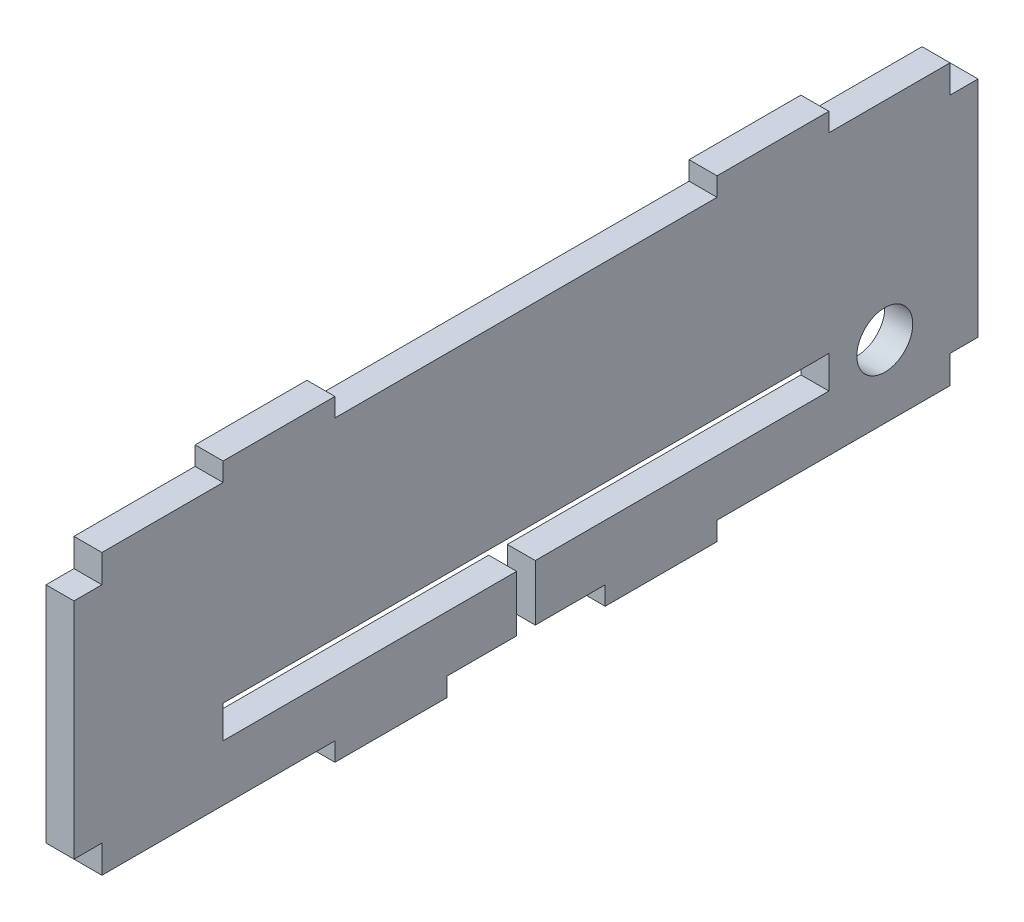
ISO-10303-21;
HEADER;
FILE_DESCRIPTION(('STEP AP214'),'2;1');
FILE_NAME('part.step','',(''),(''),'','','');
FILE_SCHEMA(('AUTOMOTIVE_DESIGN { 1 0 10303 214 1 1 1 1 }'));
ENDSEC;
DATA;
#1=APPLICATION_CONTEXT('core data for automotive mechanical design processes');
#2=APPLICATION_PROTOCOL_DEFINITION('international standard','automotive_design',2000,#1);
#3=PRODUCT_CONTEXT('',#1,'mechanical');
#4=PRODUCT('Part','Part','',(#3));
#5=PRODUCT_RELATED_PRODUCT_CATEGORY('part','',(#4));
#6=PRODUCT_DEFINITION_FORMATION('','',#4);
#7=PRODUCT_DEFINITION_CONTEXT('part definition',#1,'design');
#8=PRODUCT_DEFINITION('design','',#6,#7);
#9=PRODUCT_DEFINITION_SHAPE('','',#8);
#10=(LENGTH_UNIT() NAMED_UNIT(*) SI_UNIT(.MILLI.,.METRE.));
#11=(NAMED_UNIT(*) PLANE_ANGLE_UNIT() SI_UNIT($,.RADIAN.));
#12=(NAMED_UNIT(*) SI_UNIT($,.STERADIAN.) SOLID_ANGLE_UNIT());
#13=UNCERTAINTY_MEASURE_WITH_UNIT(LENGTH_MEASURE(1.E-05),#10,'distance_accuracy_value','');
#14=(GEOMETRIC_REPRESENTATION_CONTEXT(3) GLOBAL_UNCERTAINTY_ASSIGNED_CONTEXT((#13)) GLOBAL_UNIT_ASSIGNED_CONTEXT((#10,
#11,#12)) REPRESENTATION_CONTEXT('',''));
#15=CARTESIAN_POINT('',(0.,0.,0.));
#16=DIRECTION('',(0.,0.,1.));
#17=DIRECTION('',(1.,0.,0.));
#18=AXIS2_PLACEMENT_3D('',#15,#16,#17);
#19=CARTESIAN_POINT('',(3.,29.,0.));
#20=DIRECTION('',(0.,1.,0.));
#21=DIRECTION('',(0.,0.,1.));
#22=AXIS2_PLACEMENT_3D('',#19,#20,#21);
#23=PLANE('',#22);
#24=DIRECTION('',(0.,0.,-1.));
#25=VECTOR('',#24,1.);
#26=CARTESIAN_POINT('',(0.,29.,0.));
#27=LINE('',#26,#25);
#28=CARTESIAN_POINT('',(0.,29.,-94.));
#29=VERTEX_POINT('',#28);
#30=CARTESIAN_POINT('',(0.,29.,-97.));
#31=VERTEX_POINT('',#30);
#32=EDGE_CURVE('E389',#29,#31,#27,.T.);
#33=ORIENTED_EDGE('',*,*,#32,.F.);
#34=DIRECTION('',(-1.,0.,0.));
#35=VECTOR('',#34,1.);
#36=CARTESIAN_POINT('',(3.,29.,-94.));
#37=LINE('',#36,#35);
#38=CARTESIAN_POINT('',(3.,29.,-94.));
#39=VERTEX_POINT('',#38);
#40=EDGE_CURVE('E11',#39,#29,#37,.T.);
#41=ORIENTED_EDGE('',*,*,#40,.F.);
#42=DIRECTION('',(0.,0.,-1.));
#43=VECTOR('',#42,1.);
#44=CARTESIAN_POINT('',(3.,29.,0.));
#45=LINE('',#44,#43);
#46=CARTESIAN_POINT('',(3.,29.,-97.));
#47=VERTEX_POINT('',#46);
#48=EDGE_CURVE('E629',#39,#47,#45,.T.);
#49=ORIENTED_EDGE('',*,*,#48,.T.);
#50=DIRECTION('',(-1.,0.,0.));
#51=VECTOR('',#50,1.);
#52=CARTESIAN_POINT('',(3.,29.,-97.));
#53=LINE('',#52,#51);
#54=EDGE_CURVE('E170',#47,#31,#53,.T.);
#55=ORIENTED_EDGE('',*,*,#54,.T.);
#56=EDGE_LOOP('',(#33,#41,#49,#55));
#57=FACE_BOUND('',#56,.T.);
#58=ADVANCED_FACE('F35',(#57),#23,.T.);
#59=CARTESIAN_POINT('',(3.,0.,-94.));
#60=DIRECTION('',(0.,0.,-1.));
#61=DIRECTION('',(-1.,0.,0.));
#62=AXIS2_PLACEMENT_3D('',#59,#60,#61);
#63=PLANE('',#62);
#64=DIRECTION('',(0.,-1.,0.));
#65=VECTOR('',#64,1.);
#66=CARTESIAN_POINT('',(0.,0.,-94.));
#67=LINE('',#66,#65);
#68=CARTESIAN_POINT('',(0.,32.,-94.));
#69=VERTEX_POINT('',#68);
#70=EDGE_CURVE('E387',#69,#29,#67,.T.);
#71=ORIENTED_EDGE('',*,*,#70,.F.);
#72=DIRECTION('',(-1.,0.,0.));
#73=VECTOR('',#72,1.);
#74=CARTESIAN_POINT('',(3.,32.,-94.));
#75=LINE('',#74,#73);
#76=CARTESIAN_POINT('',(3.,32.,-94.));
#77=VERTEX_POINT('',#76);
#78=EDGE_CURVE('E44',#77,#69,#75,.T.);
#79=ORIENTED_EDGE('',*,*,#78,.F.);
#80=DIRECTION('',(0.,-1.,0.));
#81=VECTOR('',#80,1.);
#82=CARTESIAN_POINT('',(3.,0.,-94.));
#83=LINE('',#82,#81);
#84=EDGE_CURVE('E631',#77,#39,#83,.T.);
#85=ORIENTED_EDGE('',*,*,#84,.T.);
#86=ORIENTED_EDGE('',*,*,#40,.T.);
#87=EDGE_LOOP('',(#71,#79,#85,#86));
#88=FACE_BOUND('',#87,.T.);
#89=ADVANCED_FACE('F388',(#88),#63,.T.);
#90=CARTESIAN_POINT('',(3.,32.,0.));
#91=DIRECTION('',(0.,1.,0.));
#92=DIRECTION('',(0.,0.,1.));
#93=AXIS2_PLACEMENT_3D('',#90,#91,#92);
#94=PLANE('',#93);
#95=DIRECTION('',(0.,0.,-1.));
#96=VECTOR('',#95,1.);
#97=CARTESIAN_POINT('',(0.,32.,0.));
#98=LINE('',#97,#96);
#99=CARTESIAN_POINT('',(0.,32.,-81.));
#100=VERTEX_POINT('',#99);
#101=EDGE_CURVE('E379',#100,#69,#98,.T.);
#102=ORIENTED_EDGE('',*,*,#101,.F.);
#103=DIRECTION('',(-1.,0.,0.));
#104=VECTOR('',#103,1.);
#105=CARTESIAN_POINT('',(3.,32.,-81.));
#106=LINE('',#105,#104);
#107=CARTESIAN_POINT('',(3.,32.,-81.));
#108=VERTEX_POINT('',#107);
#109=EDGE_CURVE('E372',#108,#100,#106,.T.);
#110=ORIENTED_EDGE('',*,*,#109,.F.);
#111=DIRECTION('',(0.,0.,-1.));
#112=VECTOR('',#111,1.);
#113=CARTESIAN_POINT('',(3.,32.,0.));
#114=LINE('',#113,#112);
#115=EDGE_CURVE('E382',#108,#77,#114,.T.);
#116=ORIENTED_EDGE('',*,*,#115,.T.);
#117=ORIENTED_EDGE('',*,*,#78,.T.);
#118=EDGE_LOOP('',(#102,#110,#116,#117));
#119=FACE_BOUND('',#118,.T.);
#120=ADVANCED_FACE('F377',(#119),#94,.T.);
#121=CARTESIAN_POINT('',(3.,0.,-81.));
#122=DIRECTION('',(0.,0.,-1.));
#123=DIRECTION('',(-1.,0.,0.));
#124=AXIS2_PLACEMENT_3D('',#121,#122,#123);
#125=PLANE('',#124);
#126=DIRECTION('',(0.,-1.,0.));
#127=VECTOR('',#126,1.);
#128=CARTESIAN_POINT('',(0.,0.,-81.));
#129=LINE('',#128,#127);
#130=CARTESIAN_POINT('',(0.,34.,-81.));
#131=VERTEX_POINT('',#130);
#132=EDGE_CURVE('E394',#131,#100,#129,.T.);
#133=ORIENTED_EDGE('',*,*,#132,.F.);
#134=DIRECTION('',(-1.,0.,0.));
#135=VECTOR('',#134,1.);
#136=CARTESIAN_POINT('',(3.,34.,-81.));
#137=LINE('',#136,#135);
#138=CARTESIAN_POINT('',(3.,34.,-81.));
#139=VERTEX_POINT('',#138);
#140=EDGE_CURVE('E370',#139,#131,#137,.T.);
#141=ORIENTED_EDGE('',*,*,#140,.F.);
#142=DIRECTION('',(0.,-1.,0.));
#143=VECTOR('',#142,1.);
#144=CARTESIAN_POINT('',(3.,0.,-81.));
#145=LINE('',#144,#143);
#146=EDGE_CURVE('E636',#139,#108,#145,.T.);
#147=ORIENTED_EDGE('',*,*,#146,.T.);
#148=ORIENTED_EDGE('',*,*,#109,.T.);
#149=EDGE_LOOP('',(#133,#141,#147,#148));
#150=FACE_BOUND('',#149,.T.);
#151=ADVANCED_FACE('F497',(#150),#125,.T.);
#152=CARTESIAN_POINT('',(3.,34.,0.));
#153=DIRECTION('',(0.,1.,0.));
#154=DIRECTION('',(0.,0.,1.));
#155=AXIS2_PLACEMENT_3D('',#152,#153,#154);
#156=PLANE('',#155);
#157=DIRECTION('',(0.,0.,-1.));
#158=VECTOR('',#157,1.);
#159=CARTESIAN_POINT('',(0.,34.,0.));
#160=LINE('',#159,#158);
#161=CARTESIAN_POINT('',(0.,34.,-69.));
#162=VERTEX_POINT('',#161);
#163=EDGE_CURVE('E396',#162,#131,#160,.T.);
#164=ORIENTED_EDGE('',*,*,#163,.F.);
#165=DIRECTION('',(-1.,0.,0.));
#166=VECTOR('',#165,1.);
#167=CARTESIAN_POINT('',(3.,34.,-69.));
#168=LINE('',#167,#166);
#169=CARTESIAN_POINT('',(3.,34.,-69.));
#170=VERTEX_POINT('',#169);
#171=EDGE_CURVE('E368',#170,#162,#168,.T.);
#172=ORIENTED_EDGE('',*,*,#171,.F.);
#173=DIRECTION('',(0.,0.,-1.));
#174=VECTOR('',#173,1.);
#175=CARTESIAN_POINT('',(3.,34.,0.));
#176=LINE('',#175,#174);
#177=EDGE_CURVE('E639',#170,#139,#176,.T.);
#178=ORIENTED_EDGE('',*,*,#177,.T.);
#179=ORIENTED_EDGE('',*,*,#140,.T.);
#180=EDGE_LOOP('',(#164,#172,#178,#179));
#181=FACE_BOUND('',#180,.T.);
#182=ADVANCED_FACE('F500',(#181),#156,.T.);
#183=CARTESIAN_POINT('',(3.,0.,-69.));
#184=DIRECTION('',(0.,0.,1.));
#185=DIRECTION('',(1.,0.,0.));
#186=AXIS2_PLACEMENT_3D('',#183,#184,#185);
#187=PLANE('',#186);
#188=DIRECTION('',(0.,1.,0.));
#189=VECTOR('',#188,1.);
#190=CARTESIAN_POINT('',(0.,0.,-69.));
#191=LINE('',#190,#189);
#192=CARTESIAN_POINT('',(0.,32.,-69.));
#193=VERTEX_POINT('',#192);
#194=EDGE_CURVE('E401',#193,#162,#191,.T.);
#195=ORIENTED_EDGE('',*,*,#194,.F.);
#196=DIRECTION('',(-1.,0.,0.));
#197=VECTOR('',#196,1.);
#198=CARTESIAN_POINT('',(3.,32.,-69.));
#199=LINE('',#198,#197);
#200=CARTESIAN_POINT('',(3.,32.,-69.));
#201=VERTEX_POINT('',#200);
#202=EDGE_CURVE('E366',#201,#193,#199,.T.);
#203=ORIENTED_EDGE('',*,*,#202,.F.);
#204=DIRECTION('',(0.,1.,0.));
#205=VECTOR('',#204,1.);
#206=CARTESIAN_POINT('',(3.,0.,-69.));
#207=LINE('',#206,#205);
#208=EDGE_CURVE('E642',#201,#170,#207,.T.);
#209=ORIENTED_EDGE('',*,*,#208,.T.);
#210=ORIENTED_EDGE('',*,*,#171,.T.);
#211=EDGE_LOOP('',(#195,#203,#209,#210));
#212=FACE_BOUND('',#211,.T.);
#213=ADVANCED_FACE('F502',(#212),#187,.T.);
#214=CARTESIAN_POINT('',(3.,32.,0.));
#215=DIRECTION('',(0.,1.,0.));
#216=DIRECTION('',(0.,0.,1.));
#217=AXIS2_PLACEMENT_3D('',#214,#215,#216);
#218=PLANE('',#217);
#219=DIRECTION('',(0.,0.,-1.));
#220=VECTOR('',#219,1.);
#221=CARTESIAN_POINT('',(0.,32.,0.));
#222=LINE('',#221,#220);
#223=CARTESIAN_POINT('',(0.,32.,-28.));
#224=VERTEX_POINT('',#223);
#225=EDGE_CURVE('E405',#224,#193,#222,.T.);
#226=ORIENTED_EDGE('',*,*,#225,.F.);
#227=DIRECTION('',(-1.,0.,0.));
#228=VECTOR('',#227,1.);
#229=CARTESIAN_POINT('',(3.,32.,-28.));
#230=LINE('',#229,#228);
#231=CARTESIAN_POINT('',(3.,32.,-28.));
#232=VERTEX_POINT('',#231);
#233=EDGE_CURVE('E364',#232,#224,#230,.T.);
#234=ORIENTED_EDGE('',*,*,#233,.F.);
#235=DIRECTION('',(0.,0.,-1.));
#236=VECTOR('',#235,1.);
#237=CARTESIAN_POINT('',(3.,32.,0.));
#238=LINE('',#237,#236);
#239=EDGE_CURVE('E646',#232,#201,#238,.T.);
#240=ORIENTED_EDGE('',*,*,#239,.T.);
#241=ORIENTED_EDGE('',*,*,#202,.T.);
#242=EDGE_LOOP('',(#226,#234,#240,#241));
#243=FACE_BOUND('',#242,.T.);
#244=ADVANCED_FACE('F505',(#243),#218,.T.);
#245=CARTESIAN_POINT('',(3.,0.,-28.));
#246=DIRECTION('',(0.,0.,-1.));
#247=DIRECTION('',(-1.,0.,0.));
#248=AXIS2_PLACEMENT_3D('',#245,#246,#247);
#249=PLANE('',#248);
#250=DIRECTION('',(0.,-1.,0.));
#251=VECTOR('',#250,1.);
#252=CARTESIAN_POINT('',(0.,0.,-28.));
#253=LINE('',#252,#251);
#254=CARTESIAN_POINT('',(0.,34.,-28.));
#255=VERTEX_POINT('',#254);
#256=EDGE_CURVE('E408',#255,#224,#253,.T.);
#257=ORIENTED_EDGE('',*,*,#256,.F.);
#258=DIRECTION('',(-1.,0.,0.));
#259=VECTOR('',#258,1.);
#260=CARTESIAN_POINT('',(3.,34.,-28.));
#261=LINE('',#260,#259);
#262=CARTESIAN_POINT('',(3.,34.,-28.));
#263=VERTEX_POINT('',#262);
#264=EDGE_CURVE('E362',#263,#255,#261,.T.);
#265=ORIENTED_EDGE('',*,*,#264,.F.);
#266=DIRECTION('',(0.,-1.,0.));
#267=VECTOR('',#266,1.);
#268=CARTESIAN_POINT('',(3.,0.,-28.));
#269=LINE('',#268,#267);
#270=EDGE_CURVE('E649',#263,#232,#269,.T.);
#271=ORIENTED_EDGE('',*,*,#270,.T.);
#272=ORIENTED_EDGE('',*,*,#233,.T.);
#273=EDGE_LOOP('',(#257,#265,#271,#272));
#274=FACE_BOUND('',#273,.T.);
#275=ADVANCED_FACE('F509',(#274),#249,.T.);
#276=CARTESIAN_POINT('',(0.,34.,-16.));
#277=VERTEX_POINT('',#276);
#278=EDGE_CURVE('E402',#277,#255,#160,.T.);
#279=ORIENTED_EDGE('',*,*,#278,.F.);
#280=DIRECTION('',(-1.,0.,0.));
#281=VECTOR('',#280,1.);
#282=CARTESIAN_POINT('',(3.,34.,-16.));
#283=LINE('',#282,#281);
#284=CARTESIAN_POINT('',(3.,34.,-16.));
#285=VERTEX_POINT('',#284);
#286=EDGE_CURVE('E360',#285,#277,#283,.T.);
#287=ORIENTED_EDGE('',*,*,#286,.F.);
#288=EDGE_CURVE('E643',#285,#263,#176,.T.);
#289=ORIENTED_EDGE('',*,*,#288,.T.);
#290=ORIENTED_EDGE('',*,*,#264,.T.);
#291=EDGE_LOOP('',(#279,#287,#289,#290));
#292=FACE_BOUND('',#291,.T.);
#293=ADVANCED_FACE('F513',(#292),#156,.T.);
#294=CARTESIAN_POINT('',(3.,0.,-16.));
#295=DIRECTION('',(0.,0.,1.));
#296=DIRECTION('',(1.,0.,0.));
#297=AXIS2_PLACEMENT_3D('',#294,#295,#296);
#298=PLANE('',#297);
#299=DIRECTION('',(0.,1.,0.));
#300=VECTOR('',#299,1.);
#301=CARTESIAN_POINT('',(0.,0.,-16.));
#302=LINE('',#301,#300);
#303=CARTESIAN_POINT('',(0.,32.,-16.));
#304=VERTEX_POINT('',#303);
#305=EDGE_CURVE('E411',#304,#277,#302,.T.);
#306=ORIENTED_EDGE('',*,*,#305,.F.);
#307=DIRECTION('',(-1.,0.,0.));
#308=VECTOR('',#307,1.);
#309=CARTESIAN_POINT('',(3.,32.,-16.));
#310=LINE('',#309,#308);
#311=CARTESIAN_POINT('',(3.,32.,-16.));
#312=VERTEX_POINT('',#311);
#313=EDGE_CURVE('E358',#312,#304,#310,.T.);
#314=ORIENTED_EDGE('',*,*,#313,.F.);
#315=DIRECTION('',(0.,1.,0.));
#316=VECTOR('',#315,1.);
#317=CARTESIAN_POINT('',(3.,0.,-16.));
#318=LINE('',#317,#316);
#319=EDGE_CURVE('E652',#312,#285,#318,.T.);
#320=ORIENTED_EDGE('',*,*,#319,.T.);
#321=ORIENTED_EDGE('',*,*,#286,.T.);
#322=EDGE_LOOP('',(#306,#314,#320,#321));
#323=FACE_BOUND('',#322,.T.);
#324=ADVANCED_FACE('F517',(#323),#298,.T.);
#325=CARTESIAN_POINT('',(3.,32.,0.));
#326=DIRECTION('',(0.,1.,0.));
#327=DIRECTION('',(0.,0.,1.));
#328=AXIS2_PLACEMENT_3D('',#325,#326,#327);
#329=PLANE('',#328);
#330=DIRECTION('',(0.,0.,-1.));
#331=VECTOR('',#330,1.);
#332=CARTESIAN_POINT('',(0.,32.,0.));
#333=LINE('',#332,#331);
#334=CARTESIAN_POINT('',(0.,32.,-2.99999999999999));
#335=VERTEX_POINT('',#334);
#336=EDGE_CURVE('E414',#335,#304,#333,.T.);
#337=ORIENTED_EDGE('',*,*,#336,.F.);
#338=DIRECTION('',(-1.,0.,0.));
#339=VECTOR('',#338,1.);
#340=CARTESIAN_POINT('',(3.,32.,-2.99999999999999));
#341=LINE('',#340,#339);
#342=CARTESIAN_POINT('',(3.,32.,-2.99999999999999));
#343=VERTEX_POINT('',#342);
#344=EDGE_CURVE('E356',#343,#335,#341,.T.);
#345=ORIENTED_EDGE('',*,*,#344,.F.);
#346=DIRECTION('',(0.,0.,-1.));
#347=VECTOR('',#346,1.);
#348=CARTESIAN_POINT('',(3.,32.,0.));
#349=LINE('',#348,#347);
#350=EDGE_CURVE('E655',#343,#312,#349,.T.);
#351=ORIENTED_EDGE('',*,*,#350,.T.);
#352=ORIENTED_EDGE('',*,*,#313,.T.);
#353=EDGE_LOOP('',(#337,#345,#351,#352));
#354=FACE_BOUND('',#353,.T.);
#355=ADVANCED_FACE('F521',(#354),#329,.T.);
#356=CARTESIAN_POINT('',(3.,0.,-2.99999999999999));
#357=DIRECTION('',(0.,0.,1.));
#358=DIRECTION('',(1.,0.,0.));
#359=AXIS2_PLACEMENT_3D('',#356,#357,#358);
#360=PLANE('',#359);
#361=DIRECTION('',(0.,1.,0.));
#362=VECTOR('',#361,1.);
#363=CARTESIAN_POINT('',(0.,0.,-2.99999999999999));
#364=LINE('',#363,#362);
#365=CARTESIAN_POINT('',(0.,29.,-2.99999999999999));
#366=VERTEX_POINT('',#365);
#367=EDGE_CURVE('E417',#366,#335,#364,.T.);
#368=ORIENTED_EDGE('',*,*,#367,.F.);
#369=DIRECTION('',(-1.,0.,0.));
#370=VECTOR('',#369,1.);
#371=CARTESIAN_POINT('',(3.,29.,-2.99999999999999));
#372=LINE('',#371,#370);
#373=CARTESIAN_POINT('',(3.,29.,-2.99999999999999));
#374=VERTEX_POINT('',#373);
#375=EDGE_CURVE('E354',#374,#366,#372,.T.);
#376=ORIENTED_EDGE('',*,*,#375,.F.);
#377=DIRECTION('',(0.,1.,0.));
#378=VECTOR('',#377,1.);
#379=CARTESIAN_POINT('',(3.,0.,-2.99999999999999));
#380=LINE('',#379,#378);
#381=EDGE_CURVE('E658',#374,#343,#380,.T.);
#382=ORIENTED_EDGE('',*,*,#381,.T.);
#383=ORIENTED_EDGE('',*,*,#344,.T.);
#384=EDGE_LOOP('',(#368,#376,#382,#383));
#385=FACE_BOUND('',#384,.T.);
#386=ADVANCED_FACE('F525',(#385),#360,.T.);
#387=CARTESIAN_POINT('',(3.,29.,0.));
#388=DIRECTION('',(0.,1.,0.));
#389=DIRECTION('',(0.,0.,1.));
#390=AXIS2_PLACEMENT_3D('',#387,#388,#389);
#391=PLANE('',#390);
#392=DIRECTION('',(0.,0.,-1.));
#393=VECTOR('',#392,1.);
#394=CARTESIAN_POINT('',(0.,29.,0.));
#395=LINE('',#394,#393);
#396=CARTESIAN_POINT('',(0.,29.,0.));
#397=VERTEX_POINT('',#396);
#398=EDGE_CURVE('E420',#397,#366,#395,.T.);
#399=ORIENTED_EDGE('',*,*,#398,.F.);
#400=DIRECTION('',(-1.,0.,0.));
#401=VECTOR('',#400,1.);
#402=CARTESIAN_POINT('',(3.,29.,0.));
#403=LINE('',#402,#401);
#404=CARTESIAN_POINT('',(3.,29.,0.));
#405=VERTEX_POINT('',#404);
#406=EDGE_CURVE('E352',#405,#397,#403,.T.);
#407=ORIENTED_EDGE('',*,*,#406,.F.);
#408=DIRECTION('',(0.,0.,-1.));
#409=VECTOR('',#408,1.);
#410=CARTESIAN_POINT('',(3.,29.,0.));
#411=LINE('',#410,#409);
#412=EDGE_CURVE('E661',#405,#374,#411,.T.);
#413=ORIENTED_EDGE('',*,*,#412,.T.);
#414=ORIENTED_EDGE('',*,*,#375,.T.);
#415=EDGE_LOOP('',(#399,#407,#413,#414));
#416=FACE_BOUND('',#415,.T.);
#417=ADVANCED_FACE('F529',(#416),#391,.T.);
#418=CARTESIAN_POINT('',(3.,0.,0.));
#419=DIRECTION('',(0.,0.,-1.));
#420=DIRECTION('',(-1.,0.,0.));
#421=AXIS2_PLACEMENT_3D('',#418,#419,#420);
#422=PLANE('',#421);
#423=DIRECTION('',(0.,-1.,0.));
#424=VECTOR('',#423,1.);
#425=CARTESIAN_POINT('',(0.,0.,0.));
#426=LINE('',#425,#424);
#427=CARTESIAN_POINT('',(0.,5.,0.));
#428=VERTEX_POINT('',#427);
#429=EDGE_CURVE('E423',#397,#428,#426,.T.);
#430=ORIENTED_EDGE('',*,*,#429,.T.);
#431=DIRECTION('',(-1.,0.,0.));
#432=VECTOR('',#431,1.);
#433=CARTESIAN_POINT('',(3.,5.,0.));
#434=LINE('',#433,#432);
#435=CARTESIAN_POINT('',(3.,5.,0.));
#436=VERTEX_POINT('',#435);
#437=EDGE_CURVE('E349',#436,#428,#434,.T.);
#438=ORIENTED_EDGE('',*,*,#437,.F.);
#439=DIRECTION('',(0.,-1.,0.));
#440=VECTOR('',#439,1.);
#441=CARTESIAN_POINT('',(3.,0.,0.));
#442=LINE('',#441,#440);
#443=EDGE_CURVE('E664',#405,#436,#442,.T.);
#444=ORIENTED_EDGE('',*,*,#443,.F.);
#445=ORIENTED_EDGE('',*,*,#406,.T.);
#446=EDGE_LOOP('',(#430,#438,#444,#445));
#447=FACE_BOUND('',#446,.T.);
#448=ADVANCED_FACE('F533',(#447),#422,.F.);
#449=CARTESIAN_POINT('',(3.,5.,0.));
#450=DIRECTION('',(0.,1.,0.));
#451=DIRECTION('',(0.,0.,1.));
#452=AXIS2_PLACEMENT_3D('',#449,#450,#451);
#453=PLANE('',#452);
#454=DIRECTION('',(0.,0.,-1.));
#455=VECTOR('',#454,1.);
#456=CARTESIAN_POINT('',(0.,5.,0.));
#457=LINE('',#456,#455);
#458=CARTESIAN_POINT('',(0.,5.,-3.));
#459=VERTEX_POINT('',#458);
#460=EDGE_CURVE('E426',#428,#459,#457,.T.);
#461=ORIENTED_EDGE('',*,*,#460,.T.);
#462=DIRECTION('',(-1.,0.,0.));
#463=VECTOR('',#462,1.);
#464=CARTESIAN_POINT('',(3.,5.,-3.));
#465=LINE('',#464,#463);
#466=CARTESIAN_POINT('',(3.,5.,-3.));
#467=VERTEX_POINT('',#466);
#468=EDGE_CURVE('E346',#467,#459,#465,.T.);
#469=ORIENTED_EDGE('',*,*,#468,.F.);
#470=DIRECTION('',(0.,0.,-1.));
#471=VECTOR('',#470,1.);
#472=CARTESIAN_POINT('',(3.,5.,0.));
#473=LINE('',#472,#471);
#474=EDGE_CURVE('E667',#436,#467,#473,.T.);
#475=ORIENTED_EDGE('',*,*,#474,.F.);
#476=ORIENTED_EDGE('',*,*,#437,.T.);
#477=EDGE_LOOP('',(#461,#469,#475,#476));
#478=FACE_BOUND('',#477,.T.);
#479=ADVANCED_FACE('F537',(#478),#453,.F.);
#480=CARTESIAN_POINT('',(3.,0.,-3.));
#481=DIRECTION('',(0.,0.,-1.));
#482=DIRECTION('',(0.,1.,0.));
#483=AXIS2_PLACEMENT_3D('',#480,#481,#482);
#484=PLANE('',#483);
#485=DIRECTION('',(0.,-1.,0.));
#486=VECTOR('',#485,1.);
#487=CARTESIAN_POINT('',(0.,0.,-3.));
#488=LINE('',#487,#486);
#489=CARTESIAN_POINT('',(0.,2.,-3.));
#490=VERTEX_POINT('',#489);
#491=EDGE_CURVE('E429',#459,#490,#488,.T.);
#492=ORIENTED_EDGE('',*,*,#491,.T.);
#493=DIRECTION('',(-1.,0.,0.));
#494=VECTOR('',#493,1.);
#495=CARTESIAN_POINT('',(3.,2.,-3.));
#496=LINE('',#495,#494);
#497=CARTESIAN_POINT('',(3.,2.,-3.));
#498=VERTEX_POINT('',#497);
#499=EDGE_CURVE('E343',#498,#490,#496,.T.);
#500=ORIENTED_EDGE('',*,*,#499,.F.);
#501=DIRECTION('',(0.,-1.,0.));
#502=VECTOR('',#501,1.);
#503=CARTESIAN_POINT('',(3.,0.,-3.));
#504=LINE('',#503,#502);
#505=EDGE_CURVE('E670',#467,#498,#504,.T.);
#506=ORIENTED_EDGE('',*,*,#505,.F.);
#507=ORIENTED_EDGE('',*,*,#468,.T.);
#508=EDGE_LOOP('',(#492,#500,#506,#507));
#509=FACE_BOUND('',#508,.T.);
#510=ADVANCED_FACE('F541',(#509),#484,.F.);
#511=CARTESIAN_POINT('',(3.,2.,0.));
#512=DIRECTION('',(0.,1.,0.));
#513=DIRECTION('',(0.,0.,1.));
#514=AXIS2_PLACEMENT_3D('',#511,#512,#513);
#515=PLANE('',#514);
#516=DIRECTION('',(0.,0.,-1.));
#517=VECTOR('',#516,1.);
#518=CARTESIAN_POINT('',(0.,2.,0.));
#519=LINE('',#518,#517);
#520=CARTESIAN_POINT('',(0.,2.,-28.));
#521=VERTEX_POINT('',#520);
#522=EDGE_CURVE('E432',#490,#521,#519,.T.);
#523=ORIENTED_EDGE('',*,*,#522,.T.);
#524=DIRECTION('',(-1.,0.,0.));
#525=VECTOR('',#524,1.);
#526=CARTESIAN_POINT('',(3.,2.,-28.));
#527=LINE('',#526,#525);
#528=CARTESIAN_POINT('',(3.,2.,-28.));
#529=VERTEX_POINT('',#528);
#530=EDGE_CURVE('E340',#529,#521,#527,.T.);
#531=ORIENTED_EDGE('',*,*,#530,.F.);
#532=DIRECTION('',(0.,0.,-1.));
#533=VECTOR('',#532,1.);
#534=CARTESIAN_POINT('',(3.,2.,0.));
#535=LINE('',#534,#533);
#536=EDGE_CURVE('E673',#498,#529,#535,.T.);
#537=ORIENTED_EDGE('',*,*,#536,.F.);
#538=ORIENTED_EDGE('',*,*,#499,.T.);
#539=EDGE_LOOP('',(#523,#531,#537,#538));
#540=FACE_BOUND('',#539,.T.);
#541=ADVANCED_FACE('F545',(#540),#515,.F.);
#542=CARTESIAN_POINT('',(3.,0.,-28.));
#543=DIRECTION('',(0.,0.,-1.));
#544=DIRECTION('',(-1.,0.,0.));
#545=AXIS2_PLACEMENT_3D('',#542,#543,#544);
#546=PLANE('',#545);
#547=DIRECTION('',(0.,-1.,0.));
#548=VECTOR('',#547,1.);
#549=CARTESIAN_POINT('',(0.,0.,-28.));
#550=LINE('',#549,#548);
#551=CARTESIAN_POINT('',(0.,0.,-28.));
#552=VERTEX_POINT('',#551);
#553=EDGE_CURVE('E435',#521,#552,#550,.T.);
#554=ORIENTED_EDGE('',*,*,#553,.T.);
#555=DIRECTION('',(-1.,0.,0.));
#556=VECTOR('',#555,1.);
#557=CARTESIAN_POINT('',(3.,0.,-28.));
#558=LINE('',#557,#556);
#559=CARTESIAN_POINT('',(3.,0.,-28.));
#560=VERTEX_POINT('',#559);
#561=EDGE_CURVE('E337',#560,#552,#558,.T.);
#562=ORIENTED_EDGE('',*,*,#561,.F.);
#563=DIRECTION('',(0.,-1.,0.));
#564=VECTOR('',#563,1.);
#565=CARTESIAN_POINT('',(3.,0.,-28.));
#566=LINE('',#565,#564);
#567=EDGE_CURVE('E676',#529,#560,#566,.T.);
#568=ORIENTED_EDGE('',*,*,#567,.F.);
#569=ORIENTED_EDGE('',*,*,#530,.T.);
#570=EDGE_LOOP('',(#554,#562,#568,#569));
#571=FACE_BOUND('',#570,.T.);
#572=ADVANCED_FACE('F549',(#571),#546,.F.);
#573=CARTESIAN_POINT('',(3.,0.,0.));
#574=DIRECTION('',(0.,1.,0.));
#575=DIRECTION('',(0.,0.,1.));
#576=AXIS2_PLACEMENT_3D('',#573,#574,#575);
#577=PLANE('',#576);
#578=DIRECTION('',(0.,0.,-1.));
#579=VECTOR('',#578,1.);
#580=CARTESIAN_POINT('',(0.,0.,0.));
#581=LINE('',#580,#579);
#582=CARTESIAN_POINT('',(0.,0.,-40.));
#583=VERTEX_POINT('',#582);
#584=EDGE_CURVE('E438',#552,#583,#581,.T.);
#585=ORIENTED_EDGE('',*,*,#584,.T.);
#586=DIRECTION('',(-1.,0.,0.));
#587=VECTOR('',#586,1.);
#588=CARTESIAN_POINT('',(3.,0.,-40.));
#589=LINE('',#588,#587);
#590=CARTESIAN_POINT('',(3.,0.,-40.));
#591=VERTEX_POINT('',#590);
#592=EDGE_CURVE('E334',#591,#583,#589,.T.);
#593=ORIENTED_EDGE('',*,*,#592,.F.);
#594=DIRECTION('',(0.,0.,-1.));
#595=VECTOR('',#594,1.);
#596=CARTESIAN_POINT('',(3.,0.,0.));
#597=LINE('',#596,#595);
#598=EDGE_CURVE('E679',#560,#591,#597,.T.);
#599=ORIENTED_EDGE('',*,*,#598,.F.);
#600=ORIENTED_EDGE('',*,*,#561,.T.);
#601=EDGE_LOOP('',(#585,#593,#599,#600));
#602=FACE_BOUND('',#601,.T.);
#603=ADVANCED_FACE('F553',(#602),#577,.F.);
#604=CARTESIAN_POINT('',(3.,0.,-40.));
#605=DIRECTION('',(0.,0.,1.));
#606=DIRECTION('',(1.,0.,0.));
#607=AXIS2_PLACEMENT_3D('',#604,#605,#606);
#608=PLANE('',#607);
#609=DIRECTION('',(0.,1.,0.));
#610=VECTOR('',#609,1.);
#611=CARTESIAN_POINT('',(0.,0.,-40.));
#612=LINE('',#611,#610);
#613=CARTESIAN_POINT('',(0.,2.,-40.));
#614=VERTEX_POINT('',#613);
#615=EDGE_CURVE('E441',#583,#614,#612,.T.);
#616=ORIENTED_EDGE('',*,*,#615,.T.);
#617=DIRECTION('',(-1.,0.,0.));
#618=VECTOR('',#617,1.);
#619=CARTESIAN_POINT('',(3.,2.,-40.));
#620=LINE('',#619,#618);
#621=CARTESIAN_POINT('',(3.,2.,-40.));
#622=VERTEX_POINT('',#621);
#623=EDGE_CURVE('E332',#622,#614,#620,.T.);
#624=ORIENTED_EDGE('',*,*,#623,.F.);
#625=DIRECTION('',(0.,1.,0.));
#626=VECTOR('',#625,1.);
#627=CARTESIAN_POINT('',(3.,0.,-40.));
#628=LINE('',#627,#626);
#629=EDGE_CURVE('E682',#591,#622,#628,.T.);
#630=ORIENTED_EDGE('',*,*,#629,.F.);
#631=ORIENTED_EDGE('',*,*,#592,.T.);
#632=EDGE_LOOP('',(#616,#624,#630,#631));
#633=FACE_BOUND('',#632,.T.);
#634=ADVANCED_FACE('F555',(#633),#608,.F.);
#635=CARTESIAN_POINT('',(3.,2.,0.));
#636=DIRECTION('',(0.,-1.,0.));
#637=DIRECTION('',(0.,0.,-1.));
#638=AXIS2_PLACEMENT_3D('',#635,#636,#637);
#639=PLANE('',#638);
#640=DIRECTION('',(0.,0.,1.));
#641=VECTOR('',#640,1.);
#642=CARTESIAN_POINT('',(0.,2.,0.));
#643=LINE('',#642,#641);
#644=CARTESIAN_POINT('',(0.,2.,-47.5));
#645=VERTEX_POINT('',#644);
#646=EDGE_CURVE('E445',#645,#614,#643,.T.);
#647=ORIENTED_EDGE('',*,*,#646,.F.);
#648=DIRECTION('',(-1.,0.,0.));
#649=VECTOR('',#648,1.);
#650=CARTESIAN_POINT('',(3.,2.,-47.5));
#651=LINE('',#650,#649);
#652=CARTESIAN_POINT('',(3.,2.,-47.5));
#653=VERTEX_POINT('',#652);
#654=EDGE_CURVE('E330',#653,#645,#651,.T.);
#655=ORIENTED_EDGE('',*,*,#654,.F.);
#656=DIRECTION('',(0.,0.,1.));
#657=VECTOR('',#656,1.);
#658=CARTESIAN_POINT('',(3.,2.,0.));
#659=LINE('',#658,#657);
#660=EDGE_CURVE('E685',#653,#622,#659,.T.);
#661=ORIENTED_EDGE('',*,*,#660,.T.);
#662=ORIENTED_EDGE('',*,*,#623,.T.);
#663=EDGE_LOOP('',(#647,#655,#661,#662));
#664=FACE_BOUND('',#663,.T.);
#665=ADVANCED_FACE('F558',(#664),#639,.T.);
#666=CARTESIAN_POINT('',(3.,0.,-47.5));
#667=DIRECTION('',(0.,0.,-1.));
#668=DIRECTION('',(-1.,0.,0.));
#669=AXIS2_PLACEMENT_3D('',#666,#667,#668);
#670=PLANE('',#669);
#671=DIRECTION('',(0.,-1.,0.));
#672=VECTOR('',#671,1.);
#673=CARTESIAN_POINT('',(0.,0.,-47.5));
#674=LINE('',#673,#672);
#675=CARTESIAN_POINT('',(0.,8.,-47.5));
#676=VERTEX_POINT('',#675);
#677=EDGE_CURVE('E448',#676,#645,#674,.T.);
#678=ORIENTED_EDGE('',*,*,#677,.F.);
#679=DIRECTION('',(-1.,0.,0.));
#680=VECTOR('',#679,1.);
#681=CARTESIAN_POINT('',(3.,8.,-47.5));
#682=LINE('',#681,#680);
#683=CARTESIAN_POINT('',(3.,8.,-47.5));
#684=VERTEX_POINT('',#683);
#685=EDGE_CURVE('E328',#684,#676,#682,.T.);
#686=ORIENTED_EDGE('',*,*,#685,.F.);
#687=DIRECTION('',(0.,-1.,0.));
#688=VECTOR('',#687,1.);
#689=CARTESIAN_POINT('',(3.,0.,-47.5));
#690=LINE('',#689,#688);
#691=EDGE_CURVE('E688',#684,#653,#690,.T.);
#692=ORIENTED_EDGE('',*,*,#691,.T.);
#693=ORIENTED_EDGE('',*,*,#654,.T.);
#694=EDGE_LOOP('',(#678,#686,#692,#693));
#695=FACE_BOUND('',#694,.T.);
#696=ADVANCED_FACE('F562',(#695),#670,.T.);
#697=CARTESIAN_POINT('',(3.,8.,0.));
#698=DIRECTION('',(0.,1.,0.));
#699=DIRECTION('',(0.,0.,1.));
#700=AXIS2_PLACEMENT_3D('',#697,#698,#699);
#701=PLANE('',#700);
#702=DIRECTION('',(0.,0.,-1.));
#703=VECTOR('',#702,1.);
#704=CARTESIAN_POINT('',(0.,8.,0.));
#705=LINE('',#704,#703);
#706=CARTESIAN_POINT('',(0.,8.,-16.));
#707=VERTEX_POINT('',#706);
#708=EDGE_CURVE('E451',#707,#676,#705,.T.);
#709=ORIENTED_EDGE('',*,*,#708,.F.);
#710=DIRECTION('',(-1.,0.,0.));
#711=VECTOR('',#710,1.);
#712=CARTESIAN_POINT('',(3.,8.,-16.));
#713=LINE('',#712,#711);
#714=CARTESIAN_POINT('',(3.,8.,-16.));
#715=VERTEX_POINT('',#714);
#716=EDGE_CURVE('E326',#715,#707,#713,.T.);
#717=ORIENTED_EDGE('',*,*,#716,.F.);
#718=DIRECTION('',(0.,0.,-1.));
#719=VECTOR('',#718,1.);
#720=CARTESIAN_POINT('',(3.,8.,0.));
#721=LINE('',#720,#719);
#722=EDGE_CURVE('E691',#715,#684,#721,.T.);
#723=ORIENTED_EDGE('',*,*,#722,.T.);
#724=ORIENTED_EDGE('',*,*,#685,.T.);
#725=EDGE_LOOP('',(#709,#717,#723,#724));
#726=FACE_BOUND('',#725,.T.);
#727=ADVANCED_FACE('F566',(#726),#701,.T.);
#728=CARTESIAN_POINT('',(3.,0.,-16.));
#729=DIRECTION('',(0.,0.,1.));
#730=DIRECTION('',(1.,0.,0.));
#731=AXIS2_PLACEMENT_3D('',#728,#729,#730);
#732=PLANE('',#731);
#733=DIRECTION('',(0.,1.,0.));
#734=VECTOR('',#733,1.);
#735=CARTESIAN_POINT('',(0.,0.,-16.));
#736=LINE('',#735,#734);
#737=CARTESIAN_POINT('',(0.,11.5,-16.));
#738=VERTEX_POINT('',#737);
#739=EDGE_CURVE('E454',#707,#738,#736,.T.);
#740=ORIENTED_EDGE('',*,*,#739,.T.);
#741=DIRECTION('',(-1.,0.,0.));
#742=VECTOR('',#741,1.);
#743=CARTESIAN_POINT('',(3.,11.5,-16.));
#744=LINE('',#743,#742);
#745=CARTESIAN_POINT('',(3.,11.5,-16.));
#746=VERTEX_POINT('',#745);
#747=EDGE_CURVE('E323',#746,#738,#744,.T.);
#748=ORIENTED_EDGE('',*,*,#747,.F.);
#749=DIRECTION('',(0.,1.,0.));
#750=VECTOR('',#749,1.);
#751=CARTESIAN_POINT('',(3.,0.,-16.));
#752=LINE('',#751,#750);
#753=EDGE_CURVE('E694',#715,#746,#752,.T.);
#754=ORIENTED_EDGE('',*,*,#753,.F.);
#755=ORIENTED_EDGE('',*,*,#716,.T.);
#756=EDGE_LOOP('',(#740,#748,#754,#755));
#757=FACE_BOUND('',#756,.T.);
#758=ADVANCED_FACE('F570',(#757),#732,.F.);
#759=CARTESIAN_POINT('',(3.,11.5,0.));
#760=DIRECTION('',(0.,1.,0.));
#761=DIRECTION('',(0.,0.,1.));
#762=AXIS2_PLACEMENT_3D('',#759,#760,#761);
#763=PLANE('',#762);
#764=DIRECTION('',(0.,0.,-1.));
#765=VECTOR('',#764,1.);
#766=CARTESIAN_POINT('',(0.,11.5,0.));
#767=LINE('',#766,#765);
#768=CARTESIAN_POINT('',(0.,11.5,-81.));
#769=VERTEX_POINT('',#768);
#770=EDGE_CURVE('E457',#738,#769,#767,.T.);
#771=ORIENTED_EDGE('',*,*,#770,.T.);
#772=DIRECTION('',(-1.,0.,0.));
#773=VECTOR('',#772,1.);
#774=CARTESIAN_POINT('',(3.,11.5,-81.));
#775=LINE('',#774,#773);
#776=CARTESIAN_POINT('',(3.,11.5,-81.));
#777=VERTEX_POINT('',#776);
#778=EDGE_CURVE('E320',#777,#769,#775,.T.);
#779=ORIENTED_EDGE('',*,*,#778,.F.);
#780=DIRECTION('',(0.,0.,-1.));
#781=VECTOR('',#780,1.);
#782=CARTESIAN_POINT('',(3.,11.5,0.));
#783=LINE('',#782,#781);
#784=EDGE_CURVE('E697',#746,#777,#783,.T.);
#785=ORIENTED_EDGE('',*,*,#784,.F.);
#786=ORIENTED_EDGE('',*,*,#747,.T.);
#787=EDGE_LOOP('',(#771,#779,#785,#786));
#788=FACE_BOUND('',#787,.T.);
#789=ADVANCED_FACE('F574',(#788),#763,.F.);
#790=CARTESIAN_POINT('',(3.,3.21171660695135E-13,-81.));
#791=DIRECTION('',(0.,0.,-1.));
#792=DIRECTION('',(0.,1.,0.));
#793=AXIS2_PLACEMENT_3D('',#790,#791,#792);
#794=PLANE('',#793);
#795=DIRECTION('',(0.,-1.,0.));
#796=VECTOR('',#795,1.);
#797=CARTESIAN_POINT('',(0.,3.21171660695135E-13,-81.));
#798=LINE('',#797,#796);
#799=CARTESIAN_POINT('',(0.,8.,-81.));
#800=VERTEX_POINT('',#799);
#801=EDGE_CURVE('E460',#769,#800,#798,.T.);
#802=ORIENTED_EDGE('',*,*,#801,.T.);
#803=DIRECTION('',(-1.,0.,0.));
#804=VECTOR('',#803,1.);
#805=CARTESIAN_POINT('',(3.,8.,-81.));
#806=LINE('',#805,#804);
#807=CARTESIAN_POINT('',(3.,8.,-81.));
#808=VERTEX_POINT('',#807);
#809=EDGE_CURVE('E317',#808,#800,#806,.T.);
#810=ORIENTED_EDGE('',*,*,#809,.F.);
#811=DIRECTION('',(0.,-1.,0.));
#812=VECTOR('',#811,1.);
#813=CARTESIAN_POINT('',(3.,3.21171660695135E-13,-81.));
#814=LINE('',#813,#812);
#815=EDGE_CURVE('E700',#777,#808,#814,.T.);
#816=ORIENTED_EDGE('',*,*,#815,.F.);
#817=ORIENTED_EDGE('',*,*,#778,.T.);
#818=EDGE_LOOP('',(#802,#810,#816,#817));
#819=FACE_BOUND('',#818,.T.);
#820=ADVANCED_FACE('F578',(#819),#794,.F.);
#821=CARTESIAN_POINT('',(3.,7.99999999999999,0.));
#822=DIRECTION('',(0.,-1.,0.));
#823=DIRECTION('',(0.,0.,-1.));
#824=AXIS2_PLACEMENT_3D('',#821,#822,#823);
#825=PLANE('',#824);
#826=DIRECTION('',(0.,0.,1.));
#827=VECTOR('',#826,1.);
#828=CARTESIAN_POINT('',(0.,7.99999999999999,0.));
#829=LINE('',#828,#827);
#830=CARTESIAN_POINT('',(0.,7.99999999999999,-49.5));
#831=VERTEX_POINT('',#830);
#832=EDGE_CURVE('E463',#800,#831,#829,.T.);
#833=ORIENTED_EDGE('',*,*,#832,.T.);
#834=DIRECTION('',(-1.,0.,0.));
#835=VECTOR('',#834,1.);
#836=CARTESIAN_POINT('',(3.,7.99999999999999,-49.5));
#837=LINE('',#836,#835);
#838=CARTESIAN_POINT('',(3.,7.99999999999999,-49.5));
#839=VERTEX_POINT('',#838);
#840=EDGE_CURVE('E314',#839,#831,#837,.T.);
#841=ORIENTED_EDGE('',*,*,#840,.F.);
#842=DIRECTION('',(0.,0.,1.));
#843=VECTOR('',#842,1.);
#844=CARTESIAN_POINT('',(3.,7.99999999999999,0.));
#845=LINE('',#844,#843);
#846=EDGE_CURVE('E703',#808,#839,#845,.T.);
#847=ORIENTED_EDGE('',*,*,#846,.F.);
#848=ORIENTED_EDGE('',*,*,#809,.T.);
#849=EDGE_LOOP('',(#833,#841,#847,#848));
#850=FACE_BOUND('',#849,.T.);
#851=ADVANCED_FACE('F582',(#850),#825,.F.);
#852=CARTESIAN_POINT('',(3.,0.,-49.5));
#853=DIRECTION('',(0.,0.,-1.));
#854=DIRECTION('',(-1.,0.,0.));
#855=AXIS2_PLACEMENT_3D('',#852,#853,#854);
#856=PLANE('',#855);
#857=DIRECTION('',(0.,-1.,0.));
#858=VECTOR('',#857,1.);
#859=CARTESIAN_POINT('',(0.,0.,-49.5));
#860=LINE('',#859,#858);
#861=CARTESIAN_POINT('',(0.,2.,-49.5));
#862=VERTEX_POINT('',#861);
#863=EDGE_CURVE('E466',#831,#862,#860,.T.);
#864=ORIENTED_EDGE('',*,*,#863,.T.);
#865=DIRECTION('',(-1.,0.,0.));
#866=VECTOR('',#865,1.);
#867=CARTESIAN_POINT('',(3.,2.,-49.5));
#868=LINE('',#867,#866);
#869=CARTESIAN_POINT('',(3.,2.,-49.5));
#870=VERTEX_POINT('',#869);
#871=EDGE_CURVE('E311',#870,#862,#868,.T.);
#872=ORIENTED_EDGE('',*,*,#871,.F.);
#873=DIRECTION('',(0.,-1.,0.));
#874=VECTOR('',#873,1.);
#875=CARTESIAN_POINT('',(3.,0.,-49.5));
#876=LINE('',#875,#874);
#877=EDGE_CURVE('E706',#839,#870,#876,.T.);
#878=ORIENTED_EDGE('',*,*,#877,.F.);
#879=ORIENTED_EDGE('',*,*,#840,.T.);
#880=EDGE_LOOP('',(#864,#872,#878,#879));
#881=FACE_BOUND('',#880,.T.);
#882=ADVANCED_FACE('F586',(#881),#856,.F.);
#883=CARTESIAN_POINT('',(3.,2.,0.));
#884=DIRECTION('',(0.,1.,0.));
#885=DIRECTION('',(0.,0.,1.));
#886=AXIS2_PLACEMENT_3D('',#883,#884,#885);
#887=PLANE('',#886);
#888=DIRECTION('',(0.,0.,-1.));
#889=VECTOR('',#888,1.);
#890=CARTESIAN_POINT('',(0.,2.,0.));
#891=LINE('',#890,#889);
#892=CARTESIAN_POINT('',(0.,2.,-57.));
#893=VERTEX_POINT('',#892);
#894=EDGE_CURVE('E469',#862,#893,#891,.T.);
#895=ORIENTED_EDGE('',*,*,#894,.T.);
#896=DIRECTION('',(-1.,0.,0.));
#897=VECTOR('',#896,1.);
#898=CARTESIAN_POINT('',(3.,2.,-57.));
#899=LINE('',#898,#897);
#900=CARTESIAN_POINT('',(3.,2.,-57.));
#901=VERTEX_POINT('',#900);
#902=EDGE_CURVE('E308',#901,#893,#899,.T.);
#903=ORIENTED_EDGE('',*,*,#902,.F.);
#904=DIRECTION('',(0.,0.,-1.));
#905=VECTOR('',#904,1.);
#906=CARTESIAN_POINT('',(3.,2.,0.));
#907=LINE('',#906,#905);
#908=EDGE_CURVE('E709',#870,#901,#907,.T.);
#909=ORIENTED_EDGE('',*,*,#908,.F.);
#910=ORIENTED_EDGE('',*,*,#871,.T.);
#911=EDGE_LOOP('',(#895,#903,#909,#910));
#912=FACE_BOUND('',#911,.T.);
#913=ADVANCED_FACE('F590',(#912),#887,.F.);
#914=CARTESIAN_POINT('',(3.,0.,-57.));
#915=DIRECTION('',(0.,0.,-1.));
#916=DIRECTION('',(-1.,0.,0.));
#917=AXIS2_PLACEMENT_3D('',#914,#915,#916);
#918=PLANE('',#917);
#919=DIRECTION('',(0.,-1.,0.));
#920=VECTOR('',#919,1.);
#921=CARTESIAN_POINT('',(0.,0.,-57.));
#922=LINE('',#921,#920);
#923=CARTESIAN_POINT('',(0.,0.,-57.));
#924=VERTEX_POINT('',#923);
#925=EDGE_CURVE('E472',#893,#924,#922,.T.);
#926=ORIENTED_EDGE('',*,*,#925,.T.);
#927=DIRECTION('',(-1.,0.,0.));
#928=VECTOR('',#927,1.);
#929=CARTESIAN_POINT('',(3.,0.,-57.));
#930=LINE('',#929,#928);
#931=CARTESIAN_POINT('',(3.,0.,-57.));
#932=VERTEX_POINT('',#931);
#933=EDGE_CURVE('E305',#932,#924,#930,.T.);
#934=ORIENTED_EDGE('',*,*,#933,.F.);
#935=DIRECTION('',(0.,-1.,0.));
#936=VECTOR('',#935,1.);
#937=CARTESIAN_POINT('',(3.,0.,-57.));
#938=LINE('',#937,#936);
#939=EDGE_CURVE('E712',#901,#932,#938,.T.);
#940=ORIENTED_EDGE('',*,*,#939,.F.);
#941=ORIENTED_EDGE('',*,*,#902,.T.);
#942=EDGE_LOOP('',(#926,#934,#940,#941));
#943=FACE_BOUND('',#942,.T.);
#944=ADVANCED_FACE('F594',(#943),#918,.F.);
#945=CARTESIAN_POINT('',(0.,0.,-69.));
#946=VERTEX_POINT('',#945);
#947=EDGE_CURVE('E442',#924,#946,#581,.T.);
#948=ORIENTED_EDGE('',*,*,#947,.T.);
#949=DIRECTION('',(-1.,0.,0.));
#950=VECTOR('',#949,1.);
#951=CARTESIAN_POINT('',(3.,0.,-69.));
#952=LINE('',#951,#950);
#953=CARTESIAN_POINT('',(3.,0.,-69.));
#954=VERTEX_POINT('',#953);
#955=EDGE_CURVE('E302',#954,#946,#952,.T.);
#956=ORIENTED_EDGE('',*,*,#955,.F.);
#957=EDGE_CURVE('E683',#932,#954,#597,.T.);
#958=ORIENTED_EDGE('',*,*,#957,.F.);
#959=ORIENTED_EDGE('',*,*,#933,.T.);
#960=EDGE_LOOP('',(#948,#956,#958,#959));
#961=FACE_BOUND('',#960,.T.);
#962=ADVANCED_FACE('F598',(#961),#577,.F.);
#963=CARTESIAN_POINT('',(3.,-9.57567358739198E-13,-69.));
#964=DIRECTION('',(0.,0.,1.));
#965=DIRECTION('',(0.,-1.,0.));
#966=AXIS2_PLACEMENT_3D('',#963,#964,#965);
#967=PLANE('',#966);
#968=DIRECTION('',(0.,1.,0.));
#969=VECTOR('',#968,1.);
#970=CARTESIAN_POINT('',(0.,-9.57567358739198E-13,-69.));
#971=LINE('',#970,#969);
#972=CARTESIAN_POINT('',(0.,2.,-69.));
#973=VERTEX_POINT('',#972);
#974=EDGE_CURVE('E475',#946,#973,#971,.T.);
#975=ORIENTED_EDGE('',*,*,#974,.T.);
#976=DIRECTION('',(-1.,0.,0.));
#977=VECTOR('',#976,1.);
#978=CARTESIAN_POINT('',(3.,2.,-69.));
#979=LINE('',#978,#977);
#980=CARTESIAN_POINT('',(3.,2.,-69.));
#981=VERTEX_POINT('',#980);
#982=EDGE_CURVE('E295',#981,#973,#979,.T.);
#983=ORIENTED_EDGE('',*,*,#982,.F.);
#984=DIRECTION('',(0.,1.,0.));
#985=VECTOR('',#984,1.);
#986=CARTESIAN_POINT('',(3.,-9.57567358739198E-13,-69.));
#987=LINE('',#986,#985);
#988=EDGE_CURVE('E715',#954,#981,#987,.T.);
#989=ORIENTED_EDGE('',*,*,#988,.F.);
#990=ORIENTED_EDGE('',*,*,#955,.T.);
#991=EDGE_LOOP('',(#975,#983,#989,#990));
#992=FACE_BOUND('',#991,.T.);
#993=ADVANCED_FACE('F602',(#992),#967,.F.);
#994=CARTESIAN_POINT('',(3.,2.,0.));
#995=DIRECTION('',(0.,1.,0.));
#996=DIRECTION('',(0.,0.,1.));
#997=AXIS2_PLACEMENT_3D('',#994,#995,#996);
#998=PLANE('',#997);
#999=DIRECTION('',(0.,0.,-1.));
#1000=VECTOR('',#999,1.);
#1001=CARTESIAN_POINT('',(0.,2.,0.));
#1002=LINE('',#1001,#1000);
#1003=CARTESIAN_POINT('',(0.,2.,-94.));
#1004=VERTEX_POINT('',#1003);
#1005=EDGE_CURVE('E478',#973,#1004,#1002,.T.);
#1006=ORIENTED_EDGE('',*,*,#1005,.T.);
#1007=DIRECTION('',(-1.,0.,0.));
#1008=VECTOR('',#1007,1.);
#1009=CARTESIAN_POINT('',(3.,2.,-94.));
#1010=LINE('',#1009,#1008);
#1011=CARTESIAN_POINT('',(3.,2.,-94.));
#1012=VERTEX_POINT('',#1011);
#1013=EDGE_CURVE('E293',#1012,#1004,#1010,.T.);
#1014=ORIENTED_EDGE('',*,*,#1013,.F.);
#1015=DIRECTION('',(0.,0.,-1.));
#1016=VECTOR('',#1015,1.);
#1017=CARTESIAN_POINT('',(3.,2.,0.));
#1018=LINE('',#1017,#1016);
#1019=EDGE_CURVE('E286',#981,#1012,#1018,.T.);
#1020=ORIENTED_EDGE('',*,*,#1019,.F.);
#1021=ORIENTED_EDGE('',*,*,#982,.T.);
#1022=EDGE_LOOP('',(#1006,#1014,#1020,#1021));
#1023=FACE_BOUND('',#1022,.T.);
#1024=ADVANCED_FACE('F606',(#1023),#998,.F.);
#1025=CARTESIAN_POINT('',(3.,0.,-94.));
#1026=DIRECTION('',(0.,0.,1.));
#1027=DIRECTION('',(1.,0.,0.));
#1028=AXIS2_PLACEMENT_3D('',#1025,#1026,#1027);
#1029=PLANE('',#1028);
#1030=DIRECTION('',(0.,1.,0.));
#1031=VECTOR('',#1030,1.);
#1032=CARTESIAN_POINT('',(0.,0.,-94.));
#1033=LINE('',#1032,#1031);
#1034=CARTESIAN_POINT('',(0.,5.,-94.));
#1035=VERTEX_POINT('',#1034);
#1036=EDGE_CURVE('E292',#1004,#1035,#1033,.T.);
#1037=ORIENTED_EDGE('',*,*,#1036,.T.);
#1038=DIRECTION('',(-1.,0.,0.));
#1039=VECTOR('',#1038,1.);
#1040=CARTESIAN_POINT('',(3.,5.,-94.));
#1041=LINE('',#1040,#1039);
#1042=CARTESIAN_POINT('',(3.,5.,-94.));
#1043=VERTEX_POINT('',#1042);
#1044=EDGE_CURVE('E278',#1043,#1035,#1041,.T.);
#1045=ORIENTED_EDGE('',*,*,#1044,.F.);
#1046=DIRECTION('',(0.,1.,0.));
#1047=VECTOR('',#1046,1.);
#1048=CARTESIAN_POINT('',(3.,0.,-94.));
#1049=LINE('',#1048,#1047);
#1050=EDGE_CURVE('E281',#1012,#1043,#1049,.T.);
#1051=ORIENTED_EDGE('',*,*,#1050,.F.);
#1052=ORIENTED_EDGE('',*,*,#1013,.T.);
#1053=EDGE_LOOP('',(#1037,#1045,#1051,#1052));
#1054=FACE_BOUND('',#1053,.T.);
#1055=ADVANCED_FACE('F291',(#1054),#1029,.F.);
#1056=CARTESIAN_POINT('',(3.,5.,0.));
#1057=DIRECTION('',(0.,1.,0.));
#1058=DIRECTION('',(0.,0.,1.));
#1059=AXIS2_PLACEMENT_3D('',#1056,#1057,#1058);
#1060=PLANE('',#1059);
#1061=DIRECTION('',(0.,0.,-1.));
#1062=VECTOR('',#1061,1.);
#1063=CARTESIAN_POINT('',(0.,5.,0.));
#1064=LINE('',#1063,#1062);
#1065=CARTESIAN_POINT('',(0.,5.,-97.));
#1066=VERTEX_POINT('',#1065);
#1067=EDGE_CURVE('E482',#1035,#1066,#1064,.T.);
#1068=ORIENTED_EDGE('',*,*,#1067,.T.);
#1069=DIRECTION('',(-1.,0.,0.));
#1070=VECTOR('',#1069,1.);
#1071=CARTESIAN_POINT('',(3.,5.,-97.));
#1072=LINE('',#1071,#1070);
#1073=CARTESIAN_POINT('',(3.,5.,-97.));
#1074=VERTEX_POINT('',#1073);
#1075=EDGE_CURVE('E280',#1074,#1066,#1072,.T.);
#1076=ORIENTED_EDGE('',*,*,#1075,.F.);
#1077=DIRECTION('',(0.,0.,-1.));
#1078=VECTOR('',#1077,1.);
#1079=CARTESIAN_POINT('',(3.,5.,0.));
#1080=LINE('',#1079,#1078);
#1081=EDGE_CURVE('E273',#1043,#1074,#1080,.T.);
#1082=ORIENTED_EDGE('',*,*,#1081,.F.);
#1083=ORIENTED_EDGE('',*,*,#1044,.T.);
#1084=EDGE_LOOP('',(#1068,#1076,#1082,#1083));
#1085=FACE_BOUND('',#1084,.T.);
#1086=ADVANCED_FACE('F276',(#1085),#1060,.F.);
#1087=CARTESIAN_POINT('',(3.,9.75,-87.));
#1088=DIRECTION('',(-1.,0.,0.));
#1089=DIRECTION('',(0.,0.,1.));
#1090=AXIS2_PLACEMENT_3D('',#1087,#1088,#1089);
#1091=CYLINDRICAL_SURFACE('',#1090,3.00000000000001);
#1092=CARTESIAN_POINT('',(3.,9.75,-87.));
#1093=DIRECTION('',(1.,0.,0.));
#1094=DIRECTION('',(0.,0.,-1.));
#1095=AXIS2_PLACEMENT_3D('',#1092,#1093,#1094);
#1096=CIRCLE('',#1095,3.00000000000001);
#1097=CARTESIAN_POINT('',(3.,9.75,-90.));
#1098=VERTEX_POINT('',#1097);
#1099=EDGE_CURVE('E484',#1098,#1098,#1096,.T.);
#1100=ORIENTED_EDGE('',*,*,#1099,.T.);
#1101=EDGE_LOOP('',(#1100));
#1102=FACE_BOUND('',#1101,.T.);
#1103=CARTESIAN_POINT('',(0.,9.75,-87.));
#1104=DIRECTION('',(1.,0.,0.));
#1105=DIRECTION('',(0.,0.,-1.));
#1106=AXIS2_PLACEMENT_3D('',#1103,#1104,#1105);
#1107=CIRCLE('',#1106,3.00000000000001);
#1108=CARTESIAN_POINT('',(0.,9.75,-90.));
#1109=VERTEX_POINT('',#1108);
#1110=EDGE_CURVE('E487',#1109,#1109,#1107,.T.);
#1111=ORIENTED_EDGE('',*,*,#1110,.F.);
#1112=EDGE_LOOP('',(#1111));
#1113=FACE_BOUND('',#1112,.T.);
#1114=ADVANCED_FACE('F37',(#1102,#1113),#1091,.F.);
#1115=CARTESIAN_POINT('',(3.,0.,-97.));
#1116=DIRECTION('',(0.,0.,1.));
#1117=DIRECTION('',(0.,-1.,0.));
#1118=AXIS2_PLACEMENT_3D('',#1115,#1116,#1117);
#1119=PLANE('',#1118);
#1120=DIRECTION('',(0.,1.,0.));
#1121=VECTOR('',#1120,1.);
#1122=CARTESIAN_POINT('',(0.,0.,-97.));
#1123=LINE('',#1122,#1121);
#1124=EDGE_CURVE('E163',#1066,#31,#1123,.T.);
#1125=ORIENTED_EDGE('',*,*,#1124,.T.);
#1126=ORIENTED_EDGE('',*,*,#54,.F.);
#1127=DIRECTION('',(0.,1.,0.));
#1128=VECTOR('',#1127,1.);
#1129=CARTESIAN_POINT('',(3.,0.,-97.));
#1130=LINE('',#1129,#1128);
#1131=EDGE_CURVE('E52',#1074,#47,#1130,.T.);
#1132=ORIENTED_EDGE('',*,*,#1131,.F.);
#1133=ORIENTED_EDGE('',*,*,#1075,.T.);
#1134=EDGE_LOOP('',(#1125,#1126,#1132,#1133));
#1135=FACE_BOUND('',#1134,.T.);
#1136=ADVANCED_FACE('F615',(#1135),#1119,.F.);
#1137=CARTESIAN_POINT('',(3.,0.,0.));
#1138=DIRECTION('',(1.,0.,0.));
#1139=DIRECTION('',(0.,0.,-1.));
#1140=AXIS2_PLACEMENT_3D('',#1137,#1138,#1139);
#1141=PLANE('',#1140);
#1142=ORIENTED_EDGE('',*,*,#1099,.F.);
#1143=EDGE_LOOP('',(#1142));
#1144=FACE_BOUND('',#1143,.T.);
#1145=ORIENTED_EDGE('',*,*,#48,.F.);
#1146=ORIENTED_EDGE('',*,*,#84,.F.);
#1147=ORIENTED_EDGE('',*,*,#115,.F.);
#1148=ORIENTED_EDGE('',*,*,#146,.F.);
#1149=ORIENTED_EDGE('',*,*,#177,.F.);
#1150=ORIENTED_EDGE('',*,*,#208,.F.);
#1151=ORIENTED_EDGE('',*,*,#239,.F.);
#1152=ORIENTED_EDGE('',*,*,#270,.F.);
#1153=ORIENTED_EDGE('',*,*,#288,.F.);
#1154=ORIENTED_EDGE('',*,*,#319,.F.);
#1155=ORIENTED_EDGE('',*,*,#350,.F.);
#1156=ORIENTED_EDGE('',*,*,#381,.F.);
#1157=ORIENTED_EDGE('',*,*,#412,.F.);
#1158=ORIENTED_EDGE('',*,*,#443,.T.);
#1159=ORIENTED_EDGE('',*,*,#474,.T.);
#1160=ORIENTED_EDGE('',*,*,#505,.T.);
#1161=ORIENTED_EDGE('',*,*,#536,.T.);
#1162=ORIENTED_EDGE('',*,*,#567,.T.);
#1163=ORIENTED_EDGE('',*,*,#598,.T.);
#1164=ORIENTED_EDGE('',*,*,#629,.T.);
#1165=ORIENTED_EDGE('',*,*,#660,.F.);
#1166=ORIENTED_EDGE('',*,*,#691,.F.);
#1167=ORIENTED_EDGE('',*,*,#722,.F.);
#1168=ORIENTED_EDGE('',*,*,#753,.T.);
#1169=ORIENTED_EDGE('',*,*,#784,.T.);
#1170=ORIENTED_EDGE('',*,*,#815,.T.);
#1171=ORIENTED_EDGE('',*,*,#846,.T.);
#1172=ORIENTED_EDGE('',*,*,#877,.T.);
#1173=ORIENTED_EDGE('',*,*,#908,.T.);
#1174=ORIENTED_EDGE('',*,*,#939,.T.);
#1175=ORIENTED_EDGE('',*,*,#957,.T.);
#1176=ORIENTED_EDGE('',*,*,#988,.T.);
#1177=ORIENTED_EDGE('',*,*,#1019,.T.);
#1178=ORIENTED_EDGE('',*,*,#1050,.T.);
#1179=ORIENTED_EDGE('',*,*,#1081,.T.);
#1180=ORIENTED_EDGE('',*,*,#1131,.T.);
#1181=EDGE_LOOP('',(#1145,#1146,#1147,#1148,#1149,#1150,#1151,#1152,#1153,#1154,#1155,#1156,
#1157,#1158,#1159,#1160,#1161,#1162,#1163,#1164,#1165,#1166,#1167,#1168,#1169,#1170,#1171,#1172,
#1173,#1174,#1175,#1176,#1177,#1178,#1179,#1180));
#1182=FACE_BOUND('',#1181,.T.);
#1183=ADVANCED_FACE('F284',(#1144,#1182),#1141,.T.);
#1184=CARTESIAN_POINT('',(0.,0.,0.));
#1185=DIRECTION('',(1.,0.,0.));
#1186=DIRECTION('',(0.,0.,-1.));
#1187=AXIS2_PLACEMENT_3D('',#1184,#1185,#1186);
#1188=PLANE('',#1187);
#1189=ORIENTED_EDGE('',*,*,#1110,.T.);
#1190=EDGE_LOOP('',(#1189));
#1191=FACE_BOUND('',#1190,.T.);
#1192=ORIENTED_EDGE('',*,*,#32,.T.);
#1193=ORIENTED_EDGE('',*,*,#1124,.F.);
#1194=ORIENTED_EDGE('',*,*,#1067,.F.);
#1195=ORIENTED_EDGE('',*,*,#1036,.F.);
#1196=ORIENTED_EDGE('',*,*,#1005,.F.);
#1197=ORIENTED_EDGE('',*,*,#974,.F.);
#1198=ORIENTED_EDGE('',*,*,#947,.F.);
#1199=ORIENTED_EDGE('',*,*,#925,.F.);
#1200=ORIENTED_EDGE('',*,*,#894,.F.);
#1201=ORIENTED_EDGE('',*,*,#863,.F.);
#1202=ORIENTED_EDGE('',*,*,#832,.F.);
#1203=ORIENTED_EDGE('',*,*,#801,.F.);
#1204=ORIENTED_EDGE('',*,*,#770,.F.);
#1205=ORIENTED_EDGE('',*,*,#739,.F.);
#1206=ORIENTED_EDGE('',*,*,#708,.T.);
#1207=ORIENTED_EDGE('',*,*,#677,.T.);
#1208=ORIENTED_EDGE('',*,*,#646,.T.);
#1209=ORIENTED_EDGE('',*,*,#615,.F.);
#1210=ORIENTED_EDGE('',*,*,#584,.F.);
#1211=ORIENTED_EDGE('',*,*,#553,.F.);
#1212=ORIENTED_EDGE('',*,*,#522,.F.);
#1213=ORIENTED_EDGE('',*,*,#491,.F.);
#1214=ORIENTED_EDGE('',*,*,#460,.F.);
#1215=ORIENTED_EDGE('',*,*,#429,.F.);
#1216=ORIENTED_EDGE('',*,*,#398,.T.);
#1217=ORIENTED_EDGE('',*,*,#367,.T.);
#1218=ORIENTED_EDGE('',*,*,#336,.T.);
#1219=ORIENTED_EDGE('',*,*,#305,.T.);
#1220=ORIENTED_EDGE('',*,*,#278,.T.);
#1221=ORIENTED_EDGE('',*,*,#256,.T.);
#1222=ORIENTED_EDGE('',*,*,#225,.T.);
#1223=ORIENTED_EDGE('',*,*,#194,.T.);
#1224=ORIENTED_EDGE('',*,*,#163,.T.);
#1225=ORIENTED_EDGE('',*,*,#132,.T.);
#1226=ORIENTED_EDGE('',*,*,#101,.T.);
#1227=ORIENTED_EDGE('',*,*,#70,.T.);
#1228=EDGE_LOOP('',(#1192,#1193,#1194,#1195,#1196,#1197,#1198,#1199,#1200,#1201,#1202,#1203,
#1204,#1205,#1206,#1207,#1208,#1209,#1210,#1211,#1212,#1213,#1214,#1215,#1216,#1217,#1218,#1219,
#1220,#1221,#1222,#1223,#1224,#1225,#1226,#1227));
#1229=FACE_BOUND('',#1228,.T.);
#1230=ADVANCED_FACE('F391',(#1191,#1229),#1188,.F.);
#1231=CLOSED_SHELL('',(#58,#89,#120,#151,#182,#213,#244,#275,#293,#324,#355,#386,#417,#448,#479,
#510,#541,#572,#603,#634,#665,#696,#727,#758,#789,#820,#851,#882,#913,#944,#962,#993,#1024,
#1055,#1086,#1114,#1136,#1183,#1230));
#1232=MANIFOLD_SOLID_BREP('B2',#1231);
#1233=ADVANCED_BREP_SHAPE_REPRESENTATION('',(#18,#1232),#14);
#1234=SHAPE_DEFINITION_REPRESENTATION(#9,#1233);
ENDSEC;
END-ISO-10303-21;
